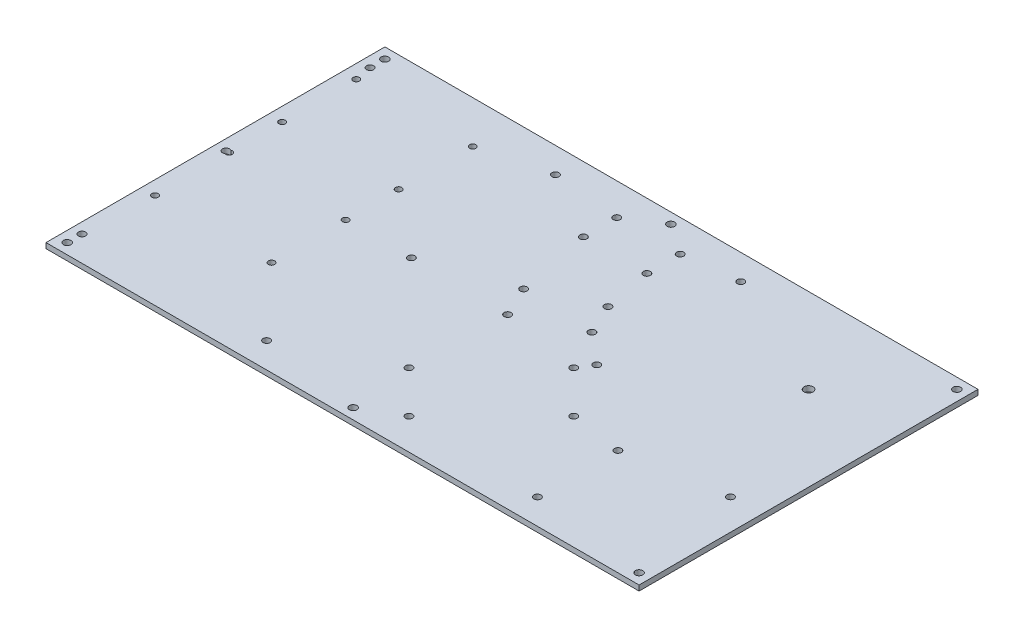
ISO-10303-21;
HEADER;
FILE_DESCRIPTION(('STEP AP214'),'2;1');
FILE_NAME('part.step','',(''),(''),'','','');
FILE_SCHEMA(('AUTOMOTIVE_DESIGN { 1 0 10303 214 1 1 1 1 }'));
ENDSEC;
DATA;
#1=APPLICATION_CONTEXT('core data for automotive mechanical design processes');
#2=APPLICATION_PROTOCOL_DEFINITION('international standard','automotive_design',2000,#1);
#3=PRODUCT_CONTEXT('',#1,'mechanical');
#4=PRODUCT('Part','Part','',(#3));
#5=PRODUCT_RELATED_PRODUCT_CATEGORY('part','',(#4));
#6=PRODUCT_DEFINITION_FORMATION('','',#4);
#7=PRODUCT_DEFINITION_CONTEXT('part definition',#1,'design');
#8=PRODUCT_DEFINITION('design','',#6,#7);
#9=PRODUCT_DEFINITION_SHAPE('','',#8);
#10=(LENGTH_UNIT() NAMED_UNIT(*) SI_UNIT(.MILLI.,.METRE.));
#11=(NAMED_UNIT(*) PLANE_ANGLE_UNIT() SI_UNIT($,.RADIAN.));
#12=(NAMED_UNIT(*) SI_UNIT($,.STERADIAN.) SOLID_ANGLE_UNIT());
#13=UNCERTAINTY_MEASURE_WITH_UNIT(LENGTH_MEASURE(1.E-05),#10,'distance_accuracy_value','');
#14=(GEOMETRIC_REPRESENTATION_CONTEXT(3) GLOBAL_UNCERTAINTY_ASSIGNED_CONTEXT((#13)) GLOBAL_UNIT_ASSIGNED_CONTEXT((#10,
#11,#12)) REPRESENTATION_CONTEXT('',''));
#15=CARTESIAN_POINT('',(0.,0.,0.));
#16=DIRECTION('',(0.,0.,1.));
#17=DIRECTION('',(1.,0.,0.));
#18=AXIS2_PLACEMENT_3D('',#15,#16,#17);
#19=CARTESIAN_POINT('',(0.,3.175,0.));
#20=DIRECTION('',(1.,0.,0.));
#21=DIRECTION('',(0.,0.,-1.));
#22=AXIS2_PLACEMENT_3D('',#19,#20,#21);
#23=PLANE('',#22);
#24=DIRECTION('',(0.,0.,1.));
#25=VECTOR('',#24,1.);
#26=CARTESIAN_POINT('',(0.,0.,0.));
#27=LINE('',#26,#25);
#28=CARTESIAN_POINT('',(0.,0.,-203.2));
#29=VERTEX_POINT('',#28);
#30=CARTESIAN_POINT('',(0.,0.,0.));
#31=VERTEX_POINT('',#30);
#32=EDGE_CURVE('E189',#29,#31,#27,.T.);
#33=ORIENTED_EDGE('',*,*,#32,.T.);
#34=DIRECTION('',(0.,-1.,0.));
#35=VECTOR('',#34,1.);
#36=CARTESIAN_POINT('',(0.,3.175,0.));
#37=LINE('',#36,#35);
#38=CARTESIAN_POINT('',(0.,3.175,0.));
#39=VERTEX_POINT('',#38);
#40=EDGE_CURVE('E99',#39,#31,#37,.T.);
#41=ORIENTED_EDGE('',*,*,#40,.F.);
#42=DIRECTION('',(0.,0.,1.));
#43=VECTOR('',#42,1.);
#44=CARTESIAN_POINT('',(0.,3.175,0.));
#45=LINE('',#44,#43);
#46=CARTESIAN_POINT('',(0.,3.175,-203.2));
#47=VERTEX_POINT('',#46);
#48=EDGE_CURVE('E190',#47,#39,#45,.T.);
#49=ORIENTED_EDGE('',*,*,#48,.F.);
#50=DIRECTION('',(0.,-1.,0.));
#51=VECTOR('',#50,1.);
#52=CARTESIAN_POINT('',(0.,3.175,-203.2));
#53=LINE('',#52,#51);
#54=EDGE_CURVE('E196',#47,#29,#53,.T.);
#55=ORIENTED_EDGE('',*,*,#54,.T.);
#56=EDGE_LOOP('',(#33,#41,#49,#55));
#57=FACE_BOUND('',#56,.T.);
#58=ADVANCED_FACE('F33',(#57),#23,.F.);
#59=CARTESIAN_POINT('',(0.,3.175,0.));
#60=DIRECTION('',(0.,0.,-1.));
#61=DIRECTION('',(-1.,0.,0.));
#62=AXIS2_PLACEMENT_3D('',#59,#60,#61);
#63=PLANE('',#62);
#64=DIRECTION('',(1.,0.,0.));
#65=VECTOR('',#64,1.);
#66=CARTESIAN_POINT('',(0.,0.,0.));
#67=LINE('',#66,#65);
#68=CARTESIAN_POINT('',(355.6,0.,0.));
#69=VERTEX_POINT('',#68);
#70=EDGE_CURVE('E199',#31,#69,#67,.T.);
#71=ORIENTED_EDGE('',*,*,#70,.T.);
#72=DIRECTION('',(0.,-1.,0.));
#73=VECTOR('',#72,1.);
#74=CARTESIAN_POINT('',(355.6,3.175,0.));
#75=LINE('',#74,#73);
#76=CARTESIAN_POINT('',(355.6,3.175,0.));
#77=VERTEX_POINT('',#76);
#78=EDGE_CURVE('E207',#77,#69,#75,.T.);
#79=ORIENTED_EDGE('',*,*,#78,.F.);
#80=DIRECTION('',(1.,0.,0.));
#81=VECTOR('',#80,1.);
#82=CARTESIAN_POINT('',(0.,3.175,0.));
#83=LINE('',#82,#81);
#84=EDGE_CURVE('E85',#39,#77,#83,.T.);
#85=ORIENTED_EDGE('',*,*,#84,.F.);
#86=ORIENTED_EDGE('',*,*,#40,.T.);
#87=EDGE_LOOP('',(#71,#79,#85,#86));
#88=FACE_BOUND('',#87,.T.);
#89=ADVANCED_FACE('F211',(#88),#63,.F.);
#90=CARTESIAN_POINT('',(355.6,3.175,0.));
#91=DIRECTION('',(-1.,0.,0.));
#92=DIRECTION('',(0.,0.,1.));
#93=AXIS2_PLACEMENT_3D('',#90,#91,#92);
#94=PLANE('',#93);
#95=DIRECTION('',(0.,0.,-1.));
#96=VECTOR('',#95,1.);
#97=CARTESIAN_POINT('',(355.6,0.,0.));
#98=LINE('',#97,#96);
#99=CARTESIAN_POINT('',(355.6,0.,-203.2));
#100=VERTEX_POINT('',#99);
#101=EDGE_CURVE('E201',#69,#100,#98,.T.);
#102=ORIENTED_EDGE('',*,*,#101,.T.);
#103=DIRECTION('',(0.,-1.,0.));
#104=VECTOR('',#103,1.);
#105=CARTESIAN_POINT('',(355.6,3.175,-203.2));
#106=LINE('',#105,#104);
#107=CARTESIAN_POINT('',(355.6,3.175,-203.2));
#108=VERTEX_POINT('',#107);
#109=EDGE_CURVE('E205',#108,#100,#106,.T.);
#110=ORIENTED_EDGE('',*,*,#109,.F.);
#111=DIRECTION('',(0.,0.,-1.));
#112=VECTOR('',#111,1.);
#113=CARTESIAN_POINT('',(355.6,3.175,0.));
#114=LINE('',#113,#112);
#115=EDGE_CURVE('E193',#77,#108,#114,.T.);
#116=ORIENTED_EDGE('',*,*,#115,.F.);
#117=ORIENTED_EDGE('',*,*,#78,.T.);
#118=EDGE_LOOP('',(#102,#110,#116,#117));
#119=FACE_BOUND('',#118,.T.);
#120=ADVANCED_FACE('F219',(#119),#94,.F.);
#121=CARTESIAN_POINT('',(0.,3.175,-203.2));
#122=DIRECTION('',(0.,0.,1.));
#123=DIRECTION('',(1.,0.,0.));
#124=AXIS2_PLACEMENT_3D('',#121,#122,#123);
#125=PLANE('',#124);
#126=DIRECTION('',(-1.,0.,0.));
#127=VECTOR('',#126,1.);
#128=CARTESIAN_POINT('',(0.,0.,-203.2));
#129=LINE('',#128,#127);
#130=EDGE_CURVE('E77',#100,#29,#129,.T.);
#131=ORIENTED_EDGE('',*,*,#130,.T.);
#132=ORIENTED_EDGE('',*,*,#54,.F.);
#133=DIRECTION('',(-1.,0.,0.));
#134=VECTOR('',#133,1.);
#135=CARTESIAN_POINT('',(0.,3.175,-203.2));
#136=LINE('',#135,#134);
#137=EDGE_CURVE('E56',#108,#47,#136,.T.);
#138=ORIENTED_EDGE('',*,*,#137,.F.);
#139=ORIENTED_EDGE('',*,*,#109,.T.);
#140=EDGE_LOOP('',(#131,#132,#138,#139));
#141=FACE_BOUND('',#140,.T.);
#142=ADVANCED_FACE('F221',(#141),#125,.F.);
#143=CARTESIAN_POINT('',(0.,3.175,0.));
#144=DIRECTION('',(0.,-1.,0.));
#145=DIRECTION('',(0.,0.,-1.));
#146=AXIS2_PLACEMENT_3D('',#143,#144,#145);
#147=PLANE('',#146);
#148=CARTESIAN_POINT('',(304.8,3.175,-152.4));
#149=DIRECTION('',(0.,1.,0.));
#150=DIRECTION('',(0.,0.,1.));
#151=AXIS2_PLACEMENT_3D('',#148,#149,#150);
#152=CIRCLE('',#151,2.70510000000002);
#153=CARTESIAN_POINT('',(304.8,3.175,-149.6949));
#154=VERTEX_POINT('',#153);
#155=EDGE_CURVE('E642',#154,#154,#152,.T.);
#156=ORIENTED_EDGE('',*,*,#155,.F.);
#157=EDGE_LOOP('',(#156));
#158=FACE_BOUND('',#157,.T.);
#159=CARTESIAN_POINT('',(158.144890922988,3.175,-164.06281126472));
#160=DIRECTION('',(0.,1.,0.));
#161=DIRECTION('',(0.,0.,1.));
#162=AXIS2_PLACEMENT_3D('',#159,#160,#161);
#163=CIRCLE('',#162,2.10819999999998);
#164=CARTESIAN_POINT('',(158.144890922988,3.175,-161.95461126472));
#165=VERTEX_POINT('',#164);
#166=EDGE_CURVE('E644',#165,#165,#163,.T.);
#167=ORIENTED_EDGE('',*,*,#166,.F.);
#168=EDGE_LOOP('',(#167));
#169=FACE_BOUND('',#168,.T.);
#170=CARTESIAN_POINT('',(158.117742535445,3.175,-184.062792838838));
#171=DIRECTION('',(0.,1.,0.));
#172=DIRECTION('',(0.,0.,1.));
#173=AXIS2_PLACEMENT_3D('',#170,#171,#172);
#174=CIRCLE('',#173,2.10819999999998);
#175=CARTESIAN_POINT('',(158.117742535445,3.175,-181.954592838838));
#176=VERTEX_POINT('',#175);
#177=EDGE_CURVE('E652',#176,#176,#174,.T.);
#178=ORIENTED_EDGE('',*,*,#177,.F.);
#179=EDGE_LOOP('',(#178));
#180=FACE_BOUND('',#179,.T.);
#181=CARTESIAN_POINT('',(196.117707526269,3.175,-184.114374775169));
#182=DIRECTION('',(0.,1.,0.));
#183=DIRECTION('',(0.,0.,1.));
#184=AXIS2_PLACEMENT_3D('',#181,#182,#183);
#185=CIRCLE('',#184,2.10819999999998);
#186=CARTESIAN_POINT('',(196.117707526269,3.175,-182.006174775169));
#187=VERTEX_POINT('',#186);
#188=EDGE_CURVE('E658',#187,#187,#185,.T.);
#189=ORIENTED_EDGE('',*,*,#188,.F.);
#190=EDGE_LOOP('',(#189));
#191=FACE_BOUND('',#190,.T.);
#192=CARTESIAN_POINT('',(196.144855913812,3.175,-164.114393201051));
#193=DIRECTION('',(0.,1.,0.));
#194=DIRECTION('',(0.,0.,1.));
#195=AXIS2_PLACEMENT_3D('',#192,#193,#194);
#196=CIRCLE('',#195,2.10819999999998);
#197=CARTESIAN_POINT('',(196.144855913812,3.175,-162.006193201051));
#198=VERTEX_POINT('',#197);
#199=EDGE_CURVE('E664',#198,#198,#196,.T.);
#200=ORIENTED_EDGE('',*,*,#199,.F.);
#201=EDGE_LOOP('',(#200));
#202=FACE_BOUND('',#201,.T.);
#203=CARTESIAN_POINT('',(167.302257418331,3.175,-119.108761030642));
#204=DIRECTION('',(0.,1.,0.));
#205=DIRECTION('',(0.,0.,1.));
#206=AXIS2_PLACEMENT_3D('',#203,#204,#205);
#207=CIRCLE('',#206,2.10819999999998);
#208=CARTESIAN_POINT('',(167.302257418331,3.175,-117.000561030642));
#209=VERTEX_POINT('',#208);
#210=EDGE_CURVE('E670',#209,#209,#207,.T.);
#211=ORIENTED_EDGE('',*,*,#210,.F.);
#212=EDGE_LOOP('',(#211));
#213=FACE_BOUND('',#212,.T.);
#214=CARTESIAN_POINT('',(175.779219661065,3.175,-100.994095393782));
#215=DIRECTION('',(0.,1.,0.));
#216=DIRECTION('',(0.,0.,1.));
#217=AXIS2_PLACEMENT_3D('',#214,#215,#216);
#218=CIRCLE('',#217,2.10819999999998);
#219=CARTESIAN_POINT('',(175.779219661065,3.175,-98.8858953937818));
#220=VERTEX_POINT('',#219);
#221=EDGE_CURVE('E676',#220,#220,#218,.T.);
#222=ORIENTED_EDGE('',*,*,#221,.F.);
#223=EDGE_LOOP('',(#222));
#224=FACE_BOUND('',#223,.T.);
#225=CARTESIAN_POINT('',(210.1970843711,3.175,-117.100323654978));
#226=DIRECTION('',(0.,1.,0.));
#227=DIRECTION('',(0.,0.,1.));
#228=AXIS2_PLACEMENT_3D('',#225,#226,#227);
#229=CIRCLE('',#228,2.10819999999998);
#230=CARTESIAN_POINT('',(210.1970843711,3.175,-114.992123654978));
#231=VERTEX_POINT('',#230);
#232=EDGE_CURVE('E682',#231,#231,#229,.T.);
#233=ORIENTED_EDGE('',*,*,#232,.F.);
#234=EDGE_LOOP('',(#233));
#235=FACE_BOUND('',#234,.T.);
#236=CARTESIAN_POINT('',(201.720122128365,3.175,-135.214989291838));
#237=DIRECTION('',(0.,1.,0.));
#238=DIRECTION('',(0.,0.,1.));
#239=AXIS2_PLACEMENT_3D('',#236,#237,#238);
#240=CIRCLE('',#239,2.10819999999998);
#241=CARTESIAN_POINT('',(201.720122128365,3.175,-133.106789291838));
#242=VERTEX_POINT('',#241);
#243=EDGE_CURVE('E688',#242,#242,#240,.T.);
#244=ORIENTED_EDGE('',*,*,#243,.F.);
#245=EDGE_LOOP('',(#244));
#246=FACE_BOUND('',#245,.T.);
#247=CARTESIAN_POINT('',(6.35,3.175,-187.96));
#248=DIRECTION('',(0.,1.,0.));
#249=DIRECTION('',(0.,0.,1.));
#250=AXIS2_PLACEMENT_3D('',#247,#248,#249);
#251=CIRCLE('',#250,2.10819999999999);
#252=CARTESIAN_POINT('',(6.35,3.175,-185.8518));
#253=VERTEX_POINT('',#252);
#254=EDGE_CURVE('E694',#253,#253,#251,.T.);
#255=ORIENTED_EDGE('',*,*,#254,.F.);
#256=EDGE_LOOP('',(#255));
#257=FACE_BOUND('',#256,.T.);
#258=CARTESIAN_POINT('',(6.35000000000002,3.175,-15.24));
#259=DIRECTION('',(0.,1.,0.));
#260=DIRECTION('',(0.,0.,1.));
#261=AXIS2_PLACEMENT_3D('',#258,#259,#260);
#262=CIRCLE('',#261,2.10819999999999);
#263=CARTESIAN_POINT('',(6.35000000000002,3.175,-13.1318));
#264=VERTEX_POINT('',#263);
#265=EDGE_CURVE('E105',#264,#264,#262,.T.);
#266=ORIENTED_EDGE('',*,*,#265,.F.);
#267=EDGE_LOOP('',(#266));
#268=FACE_BOUND('',#267,.T.);
#269=CARTESIAN_POINT('',(117.018728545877,3.175,-15.24));
#270=DIRECTION('',(0.,1.,0.));
#271=DIRECTION('',(0.,0.,1.));
#272=AXIS2_PLACEMENT_3D('',#269,#270,#271);
#273=CIRCLE('',#272,2.10819999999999);
#274=CARTESIAN_POINT('',(117.018728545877,3.175,-13.1318));
#275=VERTEX_POINT('',#274);
#276=EDGE_CURVE('E706',#275,#275,#273,.T.);
#277=ORIENTED_EDGE('',*,*,#276,.F.);
#278=EDGE_LOOP('',(#277));
#279=FACE_BOUND('',#278,.T.);
#280=CARTESIAN_POINT('',(117.475,3.175,-101.6));
#281=DIRECTION('',(0.,1.,0.));
#282=DIRECTION('',(0.,0.,1.));
#283=AXIS2_PLACEMENT_3D('',#280,#281,#282);
#284=CIRCLE('',#283,2.10819999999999);
#285=CARTESIAN_POINT('',(117.475,3.175,-99.4918));
#286=VERTEX_POINT('',#285);
#287=EDGE_CURVE('E712',#286,#286,#284,.T.);
#288=ORIENTED_EDGE('',*,*,#287,.F.);
#289=EDGE_LOOP('',(#288));
#290=FACE_BOUND('',#289,.T.);
#291=CARTESIAN_POINT('',(117.475,3.175,-187.96));
#292=DIRECTION('',(0.,1.,0.));
#293=DIRECTION('',(0.,0.,1.));
#294=AXIS2_PLACEMENT_3D('',#291,#292,#293);
#295=CIRCLE('',#294,2.10819999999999);
#296=CARTESIAN_POINT('',(117.475,3.175,-185.8518));
#297=VERTEX_POINT('',#296);
#298=EDGE_CURVE('E718',#297,#297,#295,.T.);
#299=ORIENTED_EDGE('',*,*,#298,.F.);
#300=EDGE_LOOP('',(#299));
#301=FACE_BOUND('',#300,.T.);
#302=CARTESIAN_POINT('',(228.6,3.175,-187.96));
#303=DIRECTION('',(0.,1.,0.));
#304=DIRECTION('',(0.,0.,1.));
#305=AXIS2_PLACEMENT_3D('',#302,#303,#304);
#306=CIRCLE('',#305,2.10819999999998);
#307=CARTESIAN_POINT('',(228.6,3.175,-185.8518));
#308=VERTEX_POINT('',#307);
#309=EDGE_CURVE('E724',#308,#308,#306,.T.);
#310=ORIENTED_EDGE('',*,*,#309,.F.);
#311=EDGE_LOOP('',(#310));
#312=FACE_BOUND('',#311,.T.);
#313=CARTESIAN_POINT('',(228.6,3.175,-101.6));
#314=DIRECTION('',(0.,1.,0.));
#315=DIRECTION('',(0.,0.,1.));
#316=AXIS2_PLACEMENT_3D('',#313,#314,#315);
#317=CIRCLE('',#316,2.10819999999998);
#318=CARTESIAN_POINT('',(228.6,3.175,-99.4918));
#319=VERTEX_POINT('',#318);
#320=EDGE_CURVE('E730',#319,#319,#317,.T.);
#321=ORIENTED_EDGE('',*,*,#320,.F.);
#322=EDGE_LOOP('',(#321));
#323=FACE_BOUND('',#322,.T.);
#324=CARTESIAN_POINT('',(279.4,3.175,-63.5));
#325=DIRECTION('',(0.,1.,0.));
#326=DIRECTION('',(0.,0.,1.));
#327=AXIS2_PLACEMENT_3D('',#324,#325,#326);
#328=CIRCLE('',#327,2.1082);
#329=CARTESIAN_POINT('',(279.4,3.175,-61.3918));
#330=VERTEX_POINT('',#329);
#331=EDGE_CURVE('E736',#330,#330,#328,.T.);
#332=ORIENTED_EDGE('',*,*,#331,.F.);
#333=EDGE_LOOP('',(#332));
#334=FACE_BOUND('',#333,.T.);
#335=CARTESIAN_POINT('',(279.4,3.175,-15.24));
#336=DIRECTION('',(0.,1.,0.));
#337=DIRECTION('',(0.,0.,1.));
#338=AXIS2_PLACEMENT_3D('',#335,#336,#337);
#339=CIRCLE('',#338,2.1082);
#340=CARTESIAN_POINT('',(279.4,3.175,-13.1318));
#341=VERTEX_POINT('',#340);
#342=EDGE_CURVE('E742',#341,#341,#339,.T.);
#343=ORIENTED_EDGE('',*,*,#342,.F.);
#344=EDGE_LOOP('',(#343));
#345=FACE_BOUND('',#344,.T.);
#346=CARTESIAN_POINT('',(173.824558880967,3.175,-43.7970472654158));
#347=DIRECTION('',(0.,1.,0.));
#348=DIRECTION('',(0.,0.,1.));
#349=AXIS2_PLACEMENT_3D('',#346,#347,#348);
#350=CIRCLE('',#349,2.1082);
#351=CARTESIAN_POINT('',(173.824558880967,3.175,-41.6888472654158));
#352=VERTEX_POINT('',#351);
#353=EDGE_CURVE('E748',#352,#352,#350,.T.);
#354=ORIENTED_EDGE('',*,*,#353,.F.);
#355=EDGE_LOOP('',(#354));
#356=FACE_BOUND('',#355,.T.);
#357=CARTESIAN_POINT('',(223.215967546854,3.175,-93.1884559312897));
#358=DIRECTION('',(0.,1.,0.));
#359=DIRECTION('',(0.,0.,1.));
#360=AXIS2_PLACEMENT_3D('',#357,#358,#359);
#361=CIRCLE('',#360,2.1082);
#362=CARTESIAN_POINT('',(223.215967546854,3.175,-91.0802559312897));
#363=VERTEX_POINT('',#362);
#364=EDGE_CURVE('E754',#363,#363,#361,.T.);
#365=ORIENTED_EDGE('',*,*,#364,.F.);
#366=EDGE_LOOP('',(#365));
#367=FACE_BOUND('',#366,.T.);
#368=CARTESIAN_POINT('',(248.360684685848,3.175,-68.043738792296));
#369=DIRECTION('',(0.,1.,0.));
#370=DIRECTION('',(0.,0.,1.));
#371=AXIS2_PLACEMENT_3D('',#368,#369,#370);
#372=CIRCLE('',#371,2.1082);
#373=CARTESIAN_POINT('',(248.360684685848,3.175,-65.935538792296));
#374=VERTEX_POINT('',#373);
#375=EDGE_CURVE('E760',#374,#374,#372,.T.);
#376=ORIENTED_EDGE('',*,*,#375,.F.);
#377=EDGE_LOOP('',(#376));
#378=FACE_BOUND('',#377,.T.);
#379=CARTESIAN_POINT('',(198.969276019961,3.175,-18.652330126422));
#380=DIRECTION('',(0.,1.,0.));
#381=DIRECTION('',(0.,0.,1.));
#382=AXIS2_PLACEMENT_3D('',#379,#380,#381);
#383=CIRCLE('',#382,2.1082);
#384=CARTESIAN_POINT('',(198.969276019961,3.175,-16.544130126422));
#385=VERTEX_POINT('',#384);
#386=EDGE_CURVE('E766',#385,#385,#383,.T.);
#387=ORIENTED_EDGE('',*,*,#386,.F.);
#388=EDGE_LOOP('',(#387));
#389=FACE_BOUND('',#388,.T.);
#390=CARTESIAN_POINT('',(337.269144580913,3.175,-73.1366321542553));
#391=DIRECTION('',(0.,1.,0.));
#392=DIRECTION('',(0.,0.,1.));
#393=AXIS2_PLACEMENT_3D('',#390,#391,#392);
#394=CIRCLE('',#393,2.1082);
#395=CARTESIAN_POINT('',(337.269144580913,3.175,-71.0284321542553));
#396=VERTEX_POINT('',#395);
#397=EDGE_CURVE('E772',#396,#396,#394,.T.);
#398=ORIENTED_EDGE('',*,*,#397,.F.);
#399=EDGE_LOOP('',(#398));
#400=FACE_BOUND('',#399,.T.);
#401=CARTESIAN_POINT('',(8.20480615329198,3.175,-57.1682735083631));
#402=DIRECTION('',(0.,-1.,0.));
#403=DIRECTION('',(0.,0.,-1.));
#404=AXIS2_PLACEMENT_3D('',#401,#402,#403);
#405=CIRCLE('',#404,1.89865);
#406=CARTESIAN_POINT('',(8.20480615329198,3.175,-59.0669235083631));
#407=VERTEX_POINT('',#406);
#408=EDGE_CURVE('E109',#407,#407,#405,.T.);
#409=ORIENTED_EDGE('',*,*,#408,.T.);
#410=EDGE_LOOP('',(#409));
#411=FACE_BOUND('',#410,.T.);
#412=CARTESIAN_POINT('',(8.20480615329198,3.175,-101.618273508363));
#413=DIRECTION('',(0.,-1.,0.));
#414=DIRECTION('',(0.,0.,-1.));
#415=AXIS2_PLACEMENT_3D('',#412,#413,#414);
#416=CIRCLE('',#415,1.89865);
#417=CARTESIAN_POINT('',(7.4863390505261,3.175,-103.375736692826));
#418=VERTEX_POINT('',#417);
#419=CARTESIAN_POINT('',(7.52110412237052,3.175,-99.846996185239));
#420=VERTEX_POINT('',#419);
#421=EDGE_CURVE('E108',#418,#420,#416,.T.);
#422=ORIENTED_EDGE('',*,*,#421,.T.);
#423=CARTESIAN_POINT('',(6.35000000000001,3.175,-101.6));
#424=DIRECTION('',(0.,1.,0.));
#425=DIRECTION('',(0.,0.,1.));
#426=AXIS2_PLACEMENT_3D('',#423,#424,#425);
#427=CIRCLE('',#426,2.10819999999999);
#428=EDGE_CURVE('E47',#418,#420,#427,.T.);
#429=ORIENTED_EDGE('',*,*,#428,.F.);
#430=EDGE_LOOP('',(#422,#429));
#431=FACE_BOUND('',#430,.T.);
#432=CARTESIAN_POINT('',(78.054806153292,3.175,-101.618273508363));
#433=DIRECTION('',(0.,-1.,0.));
#434=DIRECTION('',(0.,0.,-1.));
#435=AXIS2_PLACEMENT_3D('',#432,#433,#434);
#436=CIRCLE('',#435,1.89865);
#437=CARTESIAN_POINT('',(78.054806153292,3.175,-103.516923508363));
#438=VERTEX_POINT('',#437);
#439=EDGE_CURVE('E120',#438,#438,#436,.T.);
#440=ORIENTED_EDGE('',*,*,#439,.T.);
#441=EDGE_LOOP('',(#440));
#442=FACE_BOUND('',#441,.T.);
#443=CARTESIAN_POINT('',(78.054806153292,3.175,-57.1682735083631));
#444=DIRECTION('',(0.,-1.,0.));
#445=DIRECTION('',(0.,0.,-1.));
#446=AXIS2_PLACEMENT_3D('',#443,#444,#445);
#447=CIRCLE('',#446,1.89865);
#448=CARTESIAN_POINT('',(78.054806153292,3.175,-59.0669235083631));
#449=VERTEX_POINT('',#448);
#450=EDGE_CURVE('E126',#449,#449,#447,.T.);
#451=ORIENTED_EDGE('',*,*,#450,.T.);
#452=EDGE_LOOP('',(#451));
#453=FACE_BOUND('',#452,.T.);
#454=CARTESIAN_POINT('',(8.20480615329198,3.175,-133.368273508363));
#455=DIRECTION('',(0.,-1.,0.));
#456=DIRECTION('',(0.,0.,-1.));
#457=AXIS2_PLACEMENT_3D('',#454,#455,#456);
#458=CIRCLE('',#457,1.89865);
#459=CARTESIAN_POINT('',(8.20480615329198,3.175,-135.266923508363));
#460=VERTEX_POINT('',#459);
#461=EDGE_CURVE('E132',#460,#460,#458,.T.);
#462=ORIENTED_EDGE('',*,*,#461,.T.);
#463=EDGE_LOOP('',(#462));
#464=FACE_BOUND('',#463,.T.);
#465=CARTESIAN_POINT('',(78.054806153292,3.175,-133.368273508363));
#466=DIRECTION('',(0.,-1.,0.));
#467=DIRECTION('',(0.,0.,-1.));
#468=AXIS2_PLACEMENT_3D('',#465,#466,#467);
#469=CIRCLE('',#468,1.89865);
#470=CARTESIAN_POINT('',(78.054806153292,3.175,-135.266923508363));
#471=VERTEX_POINT('',#470);
#472=EDGE_CURVE('E138',#471,#471,#469,.T.);
#473=ORIENTED_EDGE('',*,*,#472,.T.);
#474=EDGE_LOOP('',(#473));
#475=FACE_BOUND('',#474,.T.);
#476=CARTESIAN_POINT('',(78.054806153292,3.175,-177.818273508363));
#477=DIRECTION('',(0.,-1.,0.));
#478=DIRECTION('',(0.,0.,-1.));
#479=AXIS2_PLACEMENT_3D('',#476,#477,#478);
#480=CIRCLE('',#479,1.89865);
#481=CARTESIAN_POINT('',(78.054806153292,3.175,-179.716923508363));
#482=VERTEX_POINT('',#481);
#483=EDGE_CURVE('E144',#482,#482,#480,.T.);
#484=ORIENTED_EDGE('',*,*,#483,.T.);
#485=EDGE_LOOP('',(#484));
#486=FACE_BOUND('',#485,.T.);
#487=CARTESIAN_POINT('',(8.20480615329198,3.175,-177.818273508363));
#488=DIRECTION('',(0.,-1.,0.));
#489=DIRECTION('',(0.,0.,-1.));
#490=AXIS2_PLACEMENT_3D('',#487,#488,#489);
#491=CIRCLE('',#490,1.89865);
#492=CARTESIAN_POINT('',(8.20480615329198,3.175,-179.716923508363));
#493=VERTEX_POINT('',#492);
#494=EDGE_CURVE('E150',#493,#493,#491,.T.);
#495=ORIENTED_EDGE('',*,*,#494,.T.);
#496=EDGE_LOOP('',(#495));
#497=FACE_BOUND('',#496,.T.);
#498=CARTESIAN_POINT('',(6.35,3.175,-196.85));
#499=DIRECTION('',(0.,1.,0.));
#500=DIRECTION('',(0.,0.,1.));
#501=AXIS2_PLACEMENT_3D('',#498,#499,#500);
#502=CIRCLE('',#501,2.24789999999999);
#503=CARTESIAN_POINT('',(6.35,3.175,-194.6021));
#504=VERTEX_POINT('',#503);
#505=EDGE_CURVE('E153',#504,#504,#502,.T.);
#506=ORIENTED_EDGE('',*,*,#505,.F.);
#507=EDGE_LOOP('',(#506));
#508=FACE_BOUND('',#507,.T.);
#509=CARTESIAN_POINT('',(177.8,3.175,-196.85));
#510=DIRECTION('',(0.,1.,0.));
#511=DIRECTION('',(0.,0.,1.));
#512=AXIS2_PLACEMENT_3D('',#509,#510,#511);
#513=CIRCLE('',#512,2.2479);
#514=CARTESIAN_POINT('',(177.8,3.175,-194.6021));
#515=VERTEX_POINT('',#514);
#516=EDGE_CURVE('E159',#515,#515,#513,.T.);
#517=ORIENTED_EDGE('',*,*,#516,.F.);
#518=EDGE_LOOP('',(#517));
#519=FACE_BOUND('',#518,.T.);
#520=CARTESIAN_POINT('',(349.25,3.175,-196.85));
#521=DIRECTION('',(0.,1.,0.));
#522=DIRECTION('',(0.,0.,1.));
#523=AXIS2_PLACEMENT_3D('',#520,#521,#522);
#524=CIRCLE('',#523,2.24789999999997);
#525=CARTESIAN_POINT('',(349.25,3.175,-194.6021));
#526=VERTEX_POINT('',#525);
#527=EDGE_CURVE('E165',#526,#526,#524,.T.);
#528=ORIENTED_EDGE('',*,*,#527,.F.);
#529=EDGE_LOOP('',(#528));
#530=FACE_BOUND('',#529,.T.);
#531=CARTESIAN_POINT('',(349.25,3.175,-6.35));
#532=DIRECTION('',(0.,1.,0.));
#533=DIRECTION('',(0.,0.,1.));
#534=AXIS2_PLACEMENT_3D('',#531,#532,#533);
#535=CIRCLE('',#534,2.24789999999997);
#536=CARTESIAN_POINT('',(349.25,3.175,-4.10210000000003));
#537=VERTEX_POINT('',#536);
#538=EDGE_CURVE('E171',#537,#537,#535,.T.);
#539=ORIENTED_EDGE('',*,*,#538,.F.);
#540=EDGE_LOOP('',(#539));
#541=FACE_BOUND('',#540,.T.);
#542=CARTESIAN_POINT('',(177.8,3.175,-6.34999999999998));
#543=DIRECTION('',(0.,1.,0.));
#544=DIRECTION('',(0.,0.,1.));
#545=AXIS2_PLACEMENT_3D('',#542,#543,#544);
#546=CIRCLE('',#545,2.2479);
#547=CARTESIAN_POINT('',(177.8,3.175,-4.10209999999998));
#548=VERTEX_POINT('',#547);
#549=EDGE_CURVE('E177',#548,#548,#546,.T.);
#550=ORIENTED_EDGE('',*,*,#549,.F.);
#551=EDGE_LOOP('',(#550));
#552=FACE_BOUND('',#551,.T.);
#553=CARTESIAN_POINT('',(6.35,3.175,-6.34999999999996));
#554=DIRECTION('',(0.,1.,0.));
#555=DIRECTION('',(0.,0.,1.));
#556=AXIS2_PLACEMENT_3D('',#553,#554,#555);
#557=CIRCLE('',#556,2.24789999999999);
#558=CARTESIAN_POINT('',(6.35,3.175,-4.10209999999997));
#559=VERTEX_POINT('',#558);
#560=EDGE_CURVE('E183',#559,#559,#557,.T.);
#561=ORIENTED_EDGE('',*,*,#560,.F.);
#562=EDGE_LOOP('',(#561));
#563=FACE_BOUND('',#562,.T.);
#564=ORIENTED_EDGE('',*,*,#48,.T.);
#565=ORIENTED_EDGE('',*,*,#84,.T.);
#566=ORIENTED_EDGE('',*,*,#115,.T.);
#567=ORIENTED_EDGE('',*,*,#137,.T.);
#568=EDGE_LOOP('',(#564,#565,#566,#567));
#569=FACE_BOUND('',#568,.T.);
#570=ADVANCED_FACE('F222',(#158,#169,#180,#191,#202,#213,#224,#235,#246,#257,#268,#279,#290,
#301,#312,#323,#334,#345,#356,#367,#378,#389,#400,#411,#431,#442,#453,#464,#475,#486,#497,#508,
#519,#530,#541,#552,#563,#569),#147,.F.);
#571=CARTESIAN_POINT('',(0.,0.,0.));
#572=DIRECTION('',(0.,-1.,0.));
#573=DIRECTION('',(0.,0.,-1.));
#574=AXIS2_PLACEMENT_3D('',#571,#572,#573);
#575=PLANE('',#574);
#576=CARTESIAN_POINT('',(304.8,0.,-152.4));
#577=DIRECTION('',(0.,1.,0.));
#578=DIRECTION('',(0.,0.,1.));
#579=AXIS2_PLACEMENT_3D('',#576,#577,#578);
#580=CIRCLE('',#579,2.70510000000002);
#581=CARTESIAN_POINT('',(304.8,0.,-149.6949));
#582=VERTEX_POINT('',#581);
#583=EDGE_CURVE('E640',#582,#582,#580,.T.);
#584=ORIENTED_EDGE('',*,*,#583,.T.);
#585=EDGE_LOOP('',(#584));
#586=FACE_BOUND('',#585,.T.);
#587=CARTESIAN_POINT('',(158.144890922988,0.,-164.06281126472));
#588=DIRECTION('',(0.,1.,0.));
#589=DIRECTION('',(0.,0.,1.));
#590=AXIS2_PLACEMENT_3D('',#587,#588,#589);
#591=CIRCLE('',#590,2.1082);
#592=CARTESIAN_POINT('',(158.144890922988,0.,-161.95461126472));
#593=VERTEX_POINT('',#592);
#594=EDGE_CURVE('E649',#593,#593,#591,.T.);
#595=ORIENTED_EDGE('',*,*,#594,.T.);
#596=EDGE_LOOP('',(#595));
#597=FACE_BOUND('',#596,.T.);
#598=CARTESIAN_POINT('',(158.117742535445,0.,-184.062792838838));
#599=DIRECTION('',(0.,1.,0.));
#600=DIRECTION('',(0.,0.,1.));
#601=AXIS2_PLACEMENT_3D('',#598,#599,#600);
#602=CIRCLE('',#601,2.1082);
#603=CARTESIAN_POINT('',(158.117742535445,0.,-181.954592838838));
#604=VERTEX_POINT('',#603);
#605=EDGE_CURVE('E655',#604,#604,#602,.T.);
#606=ORIENTED_EDGE('',*,*,#605,.T.);
#607=EDGE_LOOP('',(#606));
#608=FACE_BOUND('',#607,.T.);
#609=CARTESIAN_POINT('',(196.117707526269,0.,-184.114374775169));
#610=DIRECTION('',(0.,1.,0.));
#611=DIRECTION('',(0.,0.,1.));
#612=AXIS2_PLACEMENT_3D('',#609,#610,#611);
#613=CIRCLE('',#612,2.1082);
#614=CARTESIAN_POINT('',(196.117707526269,0.,-182.006174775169));
#615=VERTEX_POINT('',#614);
#616=EDGE_CURVE('E661',#615,#615,#613,.T.);
#617=ORIENTED_EDGE('',*,*,#616,.T.);
#618=EDGE_LOOP('',(#617));
#619=FACE_BOUND('',#618,.T.);
#620=CARTESIAN_POINT('',(196.144855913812,0.,-164.114393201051));
#621=DIRECTION('',(0.,1.,0.));
#622=DIRECTION('',(0.,0.,1.));
#623=AXIS2_PLACEMENT_3D('',#620,#621,#622);
#624=CIRCLE('',#623,2.1082);
#625=CARTESIAN_POINT('',(196.144855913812,0.,-162.006193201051));
#626=VERTEX_POINT('',#625);
#627=EDGE_CURVE('E667',#626,#626,#624,.T.);
#628=ORIENTED_EDGE('',*,*,#627,.T.);
#629=EDGE_LOOP('',(#628));
#630=FACE_BOUND('',#629,.T.);
#631=CARTESIAN_POINT('',(167.302257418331,0.,-119.108761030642));
#632=DIRECTION('',(0.,1.,0.));
#633=DIRECTION('',(0.,0.,1.));
#634=AXIS2_PLACEMENT_3D('',#631,#632,#633);
#635=CIRCLE('',#634,2.1082);
#636=CARTESIAN_POINT('',(167.302257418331,0.,-117.000561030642));
#637=VERTEX_POINT('',#636);
#638=EDGE_CURVE('E673',#637,#637,#635,.T.);
#639=ORIENTED_EDGE('',*,*,#638,.T.);
#640=EDGE_LOOP('',(#639));
#641=FACE_BOUND('',#640,.T.);
#642=CARTESIAN_POINT('',(175.779219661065,0.,-100.994095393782));
#643=DIRECTION('',(0.,1.,0.));
#644=DIRECTION('',(0.,0.,1.));
#645=AXIS2_PLACEMENT_3D('',#642,#643,#644);
#646=CIRCLE('',#645,2.1082);
#647=CARTESIAN_POINT('',(175.779219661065,0.,-98.8858953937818));
#648=VERTEX_POINT('',#647);
#649=EDGE_CURVE('E679',#648,#648,#646,.T.);
#650=ORIENTED_EDGE('',*,*,#649,.T.);
#651=EDGE_LOOP('',(#650));
#652=FACE_BOUND('',#651,.T.);
#653=CARTESIAN_POINT('',(210.1970843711,0.,-117.100323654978));
#654=DIRECTION('',(0.,1.,0.));
#655=DIRECTION('',(0.,0.,1.));
#656=AXIS2_PLACEMENT_3D('',#653,#654,#655);
#657=CIRCLE('',#656,2.1082);
#658=CARTESIAN_POINT('',(210.1970843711,0.,-114.992123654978));
#659=VERTEX_POINT('',#658);
#660=EDGE_CURVE('E685',#659,#659,#657,.T.);
#661=ORIENTED_EDGE('',*,*,#660,.T.);
#662=EDGE_LOOP('',(#661));
#663=FACE_BOUND('',#662,.T.);
#664=CARTESIAN_POINT('',(201.720122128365,0.,-135.214989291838));
#665=DIRECTION('',(0.,1.,0.));
#666=DIRECTION('',(0.,0.,1.));
#667=AXIS2_PLACEMENT_3D('',#664,#665,#666);
#668=CIRCLE('',#667,2.1082);
#669=CARTESIAN_POINT('',(201.720122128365,0.,-133.106789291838));
#670=VERTEX_POINT('',#669);
#671=EDGE_CURVE('E691',#670,#670,#668,.T.);
#672=ORIENTED_EDGE('',*,*,#671,.T.);
#673=EDGE_LOOP('',(#672));
#674=FACE_BOUND('',#673,.T.);
#675=CARTESIAN_POINT('',(6.35,0.,-187.96));
#676=DIRECTION('',(0.,1.,0.));
#677=DIRECTION('',(0.,0.,1.));
#678=AXIS2_PLACEMENT_3D('',#675,#676,#677);
#679=CIRCLE('',#678,2.1082);
#680=CARTESIAN_POINT('',(6.35,0.,-185.8518));
#681=VERTEX_POINT('',#680);
#682=EDGE_CURVE('E697',#681,#681,#679,.T.);
#683=ORIENTED_EDGE('',*,*,#682,.T.);
#684=EDGE_LOOP('',(#683));
#685=FACE_BOUND('',#684,.T.);
#686=CARTESIAN_POINT('',(6.35000000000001,0.,-101.6));
#687=DIRECTION('',(0.,1.,0.));
#688=DIRECTION('',(0.,0.,1.));
#689=AXIS2_PLACEMENT_3D('',#686,#687,#688);
#690=CIRCLE('',#689,2.1082);
#691=CARTESIAN_POINT('',(7.48633905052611,0.,-103.375736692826));
#692=VERTEX_POINT('',#691);
#693=CARTESIAN_POINT('',(7.52110412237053,0.,-99.846996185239));
#694=VERTEX_POINT('',#693);
#695=EDGE_CURVE('E94',#692,#694,#690,.T.);
#696=ORIENTED_EDGE('',*,*,#695,.T.);
#697=CARTESIAN_POINT('',(8.20480615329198,0.,-101.618273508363));
#698=DIRECTION('',(0.,-1.,0.));
#699=DIRECTION('',(0.,0.,-1.));
#700=AXIS2_PLACEMENT_3D('',#697,#698,#699);
#701=CIRCLE('',#700,1.89865);
#702=EDGE_CURVE('E104',#692,#694,#701,.T.);
#703=ORIENTED_EDGE('',*,*,#702,.F.);
#704=EDGE_LOOP('',(#696,#703));
#705=FACE_BOUND('',#704,.T.);
#706=CARTESIAN_POINT('',(6.35000000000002,0.,-15.24));
#707=DIRECTION('',(0.,1.,0.));
#708=DIRECTION('',(0.,0.,1.));
#709=AXIS2_PLACEMENT_3D('',#706,#707,#708);
#710=CIRCLE('',#709,2.1082);
#711=CARTESIAN_POINT('',(6.35000000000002,0.,-13.1318));
#712=VERTEX_POINT('',#711);
#713=EDGE_CURVE('E703',#712,#712,#710,.T.);
#714=ORIENTED_EDGE('',*,*,#713,.T.);
#715=EDGE_LOOP('',(#714));
#716=FACE_BOUND('',#715,.T.);
#717=CARTESIAN_POINT('',(117.018728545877,0.,-15.24));
#718=DIRECTION('',(0.,1.,0.));
#719=DIRECTION('',(0.,0.,1.));
#720=AXIS2_PLACEMENT_3D('',#717,#718,#719);
#721=CIRCLE('',#720,2.10819999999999);
#722=CARTESIAN_POINT('',(117.018728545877,0.,-13.1318));
#723=VERTEX_POINT('',#722);
#724=EDGE_CURVE('E709',#723,#723,#721,.T.);
#725=ORIENTED_EDGE('',*,*,#724,.T.);
#726=EDGE_LOOP('',(#725));
#727=FACE_BOUND('',#726,.T.);
#728=CARTESIAN_POINT('',(117.475,0.,-101.6));
#729=DIRECTION('',(0.,1.,0.));
#730=DIRECTION('',(0.,0.,1.));
#731=AXIS2_PLACEMENT_3D('',#728,#729,#730);
#732=CIRCLE('',#731,2.10819999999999);
#733=CARTESIAN_POINT('',(117.475,0.,-99.4918));
#734=VERTEX_POINT('',#733);
#735=EDGE_CURVE('E715',#734,#734,#732,.T.);
#736=ORIENTED_EDGE('',*,*,#735,.T.);
#737=EDGE_LOOP('',(#736));
#738=FACE_BOUND('',#737,.T.);
#739=CARTESIAN_POINT('',(117.475,0.,-187.96));
#740=DIRECTION('',(0.,1.,0.));
#741=DIRECTION('',(0.,0.,1.));
#742=AXIS2_PLACEMENT_3D('',#739,#740,#741);
#743=CIRCLE('',#742,2.10819999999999);
#744=CARTESIAN_POINT('',(117.475,0.,-185.8518));
#745=VERTEX_POINT('',#744);
#746=EDGE_CURVE('E721',#745,#745,#743,.T.);
#747=ORIENTED_EDGE('',*,*,#746,.T.);
#748=EDGE_LOOP('',(#747));
#749=FACE_BOUND('',#748,.T.);
#750=CARTESIAN_POINT('',(228.6,0.,-187.96));
#751=DIRECTION('',(0.,1.,0.));
#752=DIRECTION('',(0.,0.,1.));
#753=AXIS2_PLACEMENT_3D('',#750,#751,#752);
#754=CIRCLE('',#753,2.1082);
#755=CARTESIAN_POINT('',(228.6,0.,-185.8518));
#756=VERTEX_POINT('',#755);
#757=EDGE_CURVE('E727',#756,#756,#754,.T.);
#758=ORIENTED_EDGE('',*,*,#757,.T.);
#759=EDGE_LOOP('',(#758));
#760=FACE_BOUND('',#759,.T.);
#761=CARTESIAN_POINT('',(228.6,0.,-101.6));
#762=DIRECTION('',(0.,1.,0.));
#763=DIRECTION('',(0.,0.,1.));
#764=AXIS2_PLACEMENT_3D('',#761,#762,#763);
#765=CIRCLE('',#764,2.1082);
#766=CARTESIAN_POINT('',(228.6,0.,-99.4918));
#767=VERTEX_POINT('',#766);
#768=EDGE_CURVE('E733',#767,#767,#765,.T.);
#769=ORIENTED_EDGE('',*,*,#768,.T.);
#770=EDGE_LOOP('',(#769));
#771=FACE_BOUND('',#770,.T.);
#772=CARTESIAN_POINT('',(279.4,0.,-63.5));
#773=DIRECTION('',(0.,1.,0.));
#774=DIRECTION('',(0.,0.,1.));
#775=AXIS2_PLACEMENT_3D('',#772,#773,#774);
#776=CIRCLE('',#775,2.1082);
#777=CARTESIAN_POINT('',(279.4,0.,-61.3918));
#778=VERTEX_POINT('',#777);
#779=EDGE_CURVE('E739',#778,#778,#776,.T.);
#780=ORIENTED_EDGE('',*,*,#779,.T.);
#781=EDGE_LOOP('',(#780));
#782=FACE_BOUND('',#781,.T.);
#783=CARTESIAN_POINT('',(279.4,0.,-15.24));
#784=DIRECTION('',(0.,1.,0.));
#785=DIRECTION('',(0.,0.,1.));
#786=AXIS2_PLACEMENT_3D('',#783,#784,#785);
#787=CIRCLE('',#786,2.1082);
#788=CARTESIAN_POINT('',(279.4,0.,-13.1318));
#789=VERTEX_POINT('',#788);
#790=EDGE_CURVE('E745',#789,#789,#787,.T.);
#791=ORIENTED_EDGE('',*,*,#790,.T.);
#792=EDGE_LOOP('',(#791));
#793=FACE_BOUND('',#792,.T.);
#794=CARTESIAN_POINT('',(173.824558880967,0.,-43.7970472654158));
#795=DIRECTION('',(0.,1.,0.));
#796=DIRECTION('',(0.,0.,1.));
#797=AXIS2_PLACEMENT_3D('',#794,#795,#796);
#798=CIRCLE('',#797,2.1082);
#799=CARTESIAN_POINT('',(173.824558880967,0.,-41.6888472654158));
#800=VERTEX_POINT('',#799);
#801=EDGE_CURVE('E751',#800,#800,#798,.T.);
#802=ORIENTED_EDGE('',*,*,#801,.T.);
#803=EDGE_LOOP('',(#802));
#804=FACE_BOUND('',#803,.T.);
#805=CARTESIAN_POINT('',(223.215967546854,0.,-93.1884559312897));
#806=DIRECTION('',(0.,1.,0.));
#807=DIRECTION('',(0.,0.,1.));
#808=AXIS2_PLACEMENT_3D('',#805,#806,#807);
#809=CIRCLE('',#808,2.1082);
#810=CARTESIAN_POINT('',(223.215967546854,0.,-91.0802559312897));
#811=VERTEX_POINT('',#810);
#812=EDGE_CURVE('E757',#811,#811,#809,.T.);
#813=ORIENTED_EDGE('',*,*,#812,.T.);
#814=EDGE_LOOP('',(#813));
#815=FACE_BOUND('',#814,.T.);
#816=CARTESIAN_POINT('',(248.360684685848,0.,-68.043738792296));
#817=DIRECTION('',(0.,1.,0.));
#818=DIRECTION('',(0.,0.,1.));
#819=AXIS2_PLACEMENT_3D('',#816,#817,#818);
#820=CIRCLE('',#819,2.1082);
#821=CARTESIAN_POINT('',(248.360684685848,0.,-65.935538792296));
#822=VERTEX_POINT('',#821);
#823=EDGE_CURVE('E763',#822,#822,#820,.T.);
#824=ORIENTED_EDGE('',*,*,#823,.T.);
#825=EDGE_LOOP('',(#824));
#826=FACE_BOUND('',#825,.T.);
#827=CARTESIAN_POINT('',(198.969276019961,0.,-18.652330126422));
#828=DIRECTION('',(0.,1.,0.));
#829=DIRECTION('',(0.,0.,1.));
#830=AXIS2_PLACEMENT_3D('',#827,#828,#829);
#831=CIRCLE('',#830,2.1082);
#832=CARTESIAN_POINT('',(198.969276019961,0.,-16.544130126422));
#833=VERTEX_POINT('',#832);
#834=EDGE_CURVE('E769',#833,#833,#831,.T.);
#835=ORIENTED_EDGE('',*,*,#834,.T.);
#836=EDGE_LOOP('',(#835));
#837=FACE_BOUND('',#836,.T.);
#838=CARTESIAN_POINT('',(337.269144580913,0.,-73.1366321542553));
#839=DIRECTION('',(0.,1.,0.));
#840=DIRECTION('',(0.,0.,1.));
#841=AXIS2_PLACEMENT_3D('',#838,#839,#840);
#842=CIRCLE('',#841,2.1082);
#843=CARTESIAN_POINT('',(337.269144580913,0.,-71.0284321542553));
#844=VERTEX_POINT('',#843);
#845=EDGE_CURVE('E775',#844,#844,#842,.T.);
#846=ORIENTED_EDGE('',*,*,#845,.T.);
#847=EDGE_LOOP('',(#846));
#848=FACE_BOUND('',#847,.T.);
#849=CARTESIAN_POINT('',(8.20480615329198,0.,-57.1682735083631));
#850=DIRECTION('',(0.,-1.,0.));
#851=DIRECTION('',(0.,0.,-1.));
#852=AXIS2_PLACEMENT_3D('',#849,#850,#851);
#853=CIRCLE('',#852,1.89865);
#854=CARTESIAN_POINT('',(8.20480615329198,0.,-59.0669235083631));
#855=VERTEX_POINT('',#854);
#856=EDGE_CURVE('E114',#855,#855,#853,.T.);
#857=ORIENTED_EDGE('',*,*,#856,.F.);
#858=EDGE_LOOP('',(#857));
#859=FACE_BOUND('',#858,.T.);
#860=CARTESIAN_POINT('',(78.054806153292,0.,-101.618273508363));
#861=DIRECTION('',(0.,-1.,0.));
#862=DIRECTION('',(0.,0.,-1.));
#863=AXIS2_PLACEMENT_3D('',#860,#861,#862);
#864=CIRCLE('',#863,1.89865);
#865=CARTESIAN_POINT('',(78.054806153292,0.,-103.516923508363));
#866=VERTEX_POINT('',#865);
#867=EDGE_CURVE('E111',#866,#866,#864,.T.);
#868=ORIENTED_EDGE('',*,*,#867,.F.);
#869=EDGE_LOOP('',(#868));
#870=FACE_BOUND('',#869,.T.);
#871=CARTESIAN_POINT('',(78.054806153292,0.,-57.1682735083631));
#872=DIRECTION('',(0.,-1.,0.));
#873=DIRECTION('',(0.,0.,-1.));
#874=AXIS2_PLACEMENT_3D('',#871,#872,#873);
#875=CIRCLE('',#874,1.89865);
#876=CARTESIAN_POINT('',(78.054806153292,0.,-59.0669235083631));
#877=VERTEX_POINT('',#876);
#878=EDGE_CURVE('E123',#877,#877,#875,.T.);
#879=ORIENTED_EDGE('',*,*,#878,.F.);
#880=EDGE_LOOP('',(#879));
#881=FACE_BOUND('',#880,.T.);
#882=CARTESIAN_POINT('',(8.20480615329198,0.,-133.368273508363));
#883=DIRECTION('',(0.,-1.,0.));
#884=DIRECTION('',(0.,0.,-1.));
#885=AXIS2_PLACEMENT_3D('',#882,#883,#884);
#886=CIRCLE('',#885,1.89865);
#887=CARTESIAN_POINT('',(8.20480615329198,0.,-135.266923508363));
#888=VERTEX_POINT('',#887);
#889=EDGE_CURVE('E129',#888,#888,#886,.T.);
#890=ORIENTED_EDGE('',*,*,#889,.F.);
#891=EDGE_LOOP('',(#890));
#892=FACE_BOUND('',#891,.T.);
#893=CARTESIAN_POINT('',(78.054806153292,0.,-133.368273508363));
#894=DIRECTION('',(0.,-1.,0.));
#895=DIRECTION('',(0.,0.,-1.));
#896=AXIS2_PLACEMENT_3D('',#893,#894,#895);
#897=CIRCLE('',#896,1.89865);
#898=CARTESIAN_POINT('',(78.054806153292,0.,-135.266923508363));
#899=VERTEX_POINT('',#898);
#900=EDGE_CURVE('E135',#899,#899,#897,.T.);
#901=ORIENTED_EDGE('',*,*,#900,.F.);
#902=EDGE_LOOP('',(#901));
#903=FACE_BOUND('',#902,.T.);
#904=CARTESIAN_POINT('',(78.054806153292,0.,-177.818273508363));
#905=DIRECTION('',(0.,-1.,0.));
#906=DIRECTION('',(0.,0.,-1.));
#907=AXIS2_PLACEMENT_3D('',#904,#905,#906);
#908=CIRCLE('',#907,1.89865);
#909=CARTESIAN_POINT('',(78.054806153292,0.,-179.716923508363));
#910=VERTEX_POINT('',#909);
#911=EDGE_CURVE('E141',#910,#910,#908,.T.);
#912=ORIENTED_EDGE('',*,*,#911,.F.);
#913=EDGE_LOOP('',(#912));
#914=FACE_BOUND('',#913,.T.);
#915=CARTESIAN_POINT('',(8.20480615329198,0.,-177.818273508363));
#916=DIRECTION('',(0.,-1.,0.));
#917=DIRECTION('',(0.,0.,-1.));
#918=AXIS2_PLACEMENT_3D('',#915,#916,#917);
#919=CIRCLE('',#918,1.89865);
#920=CARTESIAN_POINT('',(8.20480615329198,0.,-179.716923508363));
#921=VERTEX_POINT('',#920);
#922=EDGE_CURVE('E147',#921,#921,#919,.T.);
#923=ORIENTED_EDGE('',*,*,#922,.F.);
#924=EDGE_LOOP('',(#923));
#925=FACE_BOUND('',#924,.T.);
#926=CARTESIAN_POINT('',(6.35,0.,-196.85));
#927=DIRECTION('',(0.,1.,0.));
#928=DIRECTION('',(0.,0.,1.));
#929=AXIS2_PLACEMENT_3D('',#926,#927,#928);
#930=CIRCLE('',#929,2.2479);
#931=CARTESIAN_POINT('',(6.35,0.,-194.6021));
#932=VERTEX_POINT('',#931);
#933=EDGE_CURVE('E156',#932,#932,#930,.T.);
#934=ORIENTED_EDGE('',*,*,#933,.T.);
#935=EDGE_LOOP('',(#934));
#936=FACE_BOUND('',#935,.T.);
#937=CARTESIAN_POINT('',(177.8,0.,-196.85));
#938=DIRECTION('',(0.,1.,0.));
#939=DIRECTION('',(0.,0.,1.));
#940=AXIS2_PLACEMENT_3D('',#937,#938,#939);
#941=CIRCLE('',#940,2.2479);
#942=CARTESIAN_POINT('',(177.8,0.,-194.6021));
#943=VERTEX_POINT('',#942);
#944=EDGE_CURVE('E162',#943,#943,#941,.T.);
#945=ORIENTED_EDGE('',*,*,#944,.T.);
#946=EDGE_LOOP('',(#945));
#947=FACE_BOUND('',#946,.T.);
#948=CARTESIAN_POINT('',(349.25,0.,-196.85));
#949=DIRECTION('',(0.,1.,0.));
#950=DIRECTION('',(0.,0.,1.));
#951=AXIS2_PLACEMENT_3D('',#948,#949,#950);
#952=CIRCLE('',#951,2.24789999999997);
#953=CARTESIAN_POINT('',(349.25,0.,-194.6021));
#954=VERTEX_POINT('',#953);
#955=EDGE_CURVE('E168',#954,#954,#952,.T.);
#956=ORIENTED_EDGE('',*,*,#955,.T.);
#957=EDGE_LOOP('',(#956));
#958=FACE_BOUND('',#957,.T.);
#959=CARTESIAN_POINT('',(349.25,0.,-6.35));
#960=DIRECTION('',(0.,1.,0.));
#961=DIRECTION('',(0.,0.,1.));
#962=AXIS2_PLACEMENT_3D('',#959,#960,#961);
#963=CIRCLE('',#962,2.24789999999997);
#964=CARTESIAN_POINT('',(349.25,0.,-4.10210000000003));
#965=VERTEX_POINT('',#964);
#966=EDGE_CURVE('E174',#965,#965,#963,.T.);
#967=ORIENTED_EDGE('',*,*,#966,.T.);
#968=EDGE_LOOP('',(#967));
#969=FACE_BOUND('',#968,.T.);
#970=CARTESIAN_POINT('',(177.8,0.,-6.34999999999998));
#971=DIRECTION('',(0.,1.,0.));
#972=DIRECTION('',(0.,0.,1.));
#973=AXIS2_PLACEMENT_3D('',#970,#971,#972);
#974=CIRCLE('',#973,2.2479);
#975=CARTESIAN_POINT('',(177.8,0.,-4.10209999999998));
#976=VERTEX_POINT('',#975);
#977=EDGE_CURVE('E180',#976,#976,#974,.T.);
#978=ORIENTED_EDGE('',*,*,#977,.T.);
#979=EDGE_LOOP('',(#978));
#980=FACE_BOUND('',#979,.T.);
#981=CARTESIAN_POINT('',(6.35,0.,-6.34999999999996));
#982=DIRECTION('',(0.,1.,0.));
#983=DIRECTION('',(0.,0.,1.));
#984=AXIS2_PLACEMENT_3D('',#981,#982,#983);
#985=CIRCLE('',#984,2.2479);
#986=CARTESIAN_POINT('',(6.35,0.,-4.10209999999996));
#987=VERTEX_POINT('',#986);
#988=EDGE_CURVE('E186',#987,#987,#985,.T.);
#989=ORIENTED_EDGE('',*,*,#988,.T.);
#990=EDGE_LOOP('',(#989));
#991=FACE_BOUND('',#990,.T.);
#992=ORIENTED_EDGE('',*,*,#32,.F.);
#993=ORIENTED_EDGE('',*,*,#130,.F.);
#994=ORIENTED_EDGE('',*,*,#101,.F.);
#995=ORIENTED_EDGE('',*,*,#70,.F.);
#996=EDGE_LOOP('',(#992,#993,#994,#995));
#997=FACE_BOUND('',#996,.T.);
#998=ADVANCED_FACE('F102',(#586,#597,#608,#619,#630,#641,#652,#663,#674,#685,#705,#716,#727,
#738,#749,#760,#771,#782,#793,#804,#815,#826,#837,#848,#859,#870,#881,#892,#903,#914,#925,#936,
#947,#958,#969,#980,#991,#997),#575,.T.);
#999=CARTESIAN_POINT('',(6.35,3.175,-6.34999999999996));
#1000=DIRECTION('',(0.,1.,0.));
#1001=DIRECTION('',(0.,0.,1.));
#1002=AXIS2_PLACEMENT_3D('',#999,#1000,#1001);
#1003=CYLINDRICAL_SURFACE('',#1002,2.24789999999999);
#1004=ORIENTED_EDGE('',*,*,#988,.F.);
#1005=EDGE_LOOP('',(#1004));
#1006=FACE_BOUND('',#1005,.T.);
#1007=ORIENTED_EDGE('',*,*,#560,.T.);
#1008=EDGE_LOOP('',(#1007));
#1009=FACE_BOUND('',#1008,.T.);
#1010=ADVANCED_FACE('F230',(#1006,#1009),#1003,.F.);
#1011=CARTESIAN_POINT('',(177.8,3.175,-6.34999999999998));
#1012=DIRECTION('',(0.,1.,0.));
#1013=DIRECTION('',(0.,0.,1.));
#1014=AXIS2_PLACEMENT_3D('',#1011,#1012,#1013);
#1015=CYLINDRICAL_SURFACE('',#1014,2.2479);
#1016=ORIENTED_EDGE('',*,*,#977,.F.);
#1017=EDGE_LOOP('',(#1016));
#1018=FACE_BOUND('',#1017,.T.);
#1019=ORIENTED_EDGE('',*,*,#549,.T.);
#1020=EDGE_LOOP('',(#1019));
#1021=FACE_BOUND('',#1020,.T.);
#1022=ADVANCED_FACE('F270',(#1018,#1021),#1015,.F.);
#1023=CARTESIAN_POINT('',(349.25,3.175,-6.35));
#1024=DIRECTION('',(0.,1.,0.));
#1025=DIRECTION('',(0.,0.,1.));
#1026=AXIS2_PLACEMENT_3D('',#1023,#1024,#1025);
#1027=CYLINDRICAL_SURFACE('',#1026,2.24789999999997);
#1028=ORIENTED_EDGE('',*,*,#966,.F.);
#1029=EDGE_LOOP('',(#1028));
#1030=FACE_BOUND('',#1029,.T.);
#1031=ORIENTED_EDGE('',*,*,#538,.T.);
#1032=EDGE_LOOP('',(#1031));
#1033=FACE_BOUND('',#1032,.T.);
#1034=ADVANCED_FACE('F276',(#1030,#1033),#1027,.F.);
#1035=CARTESIAN_POINT('',(349.25,3.175,-196.85));
#1036=DIRECTION('',(0.,1.,0.));
#1037=DIRECTION('',(0.,0.,1.));
#1038=AXIS2_PLACEMENT_3D('',#1035,#1036,#1037);
#1039=CYLINDRICAL_SURFACE('',#1038,2.24789999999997);
#1040=ORIENTED_EDGE('',*,*,#955,.F.);
#1041=EDGE_LOOP('',(#1040));
#1042=FACE_BOUND('',#1041,.T.);
#1043=ORIENTED_EDGE('',*,*,#527,.T.);
#1044=EDGE_LOOP('',(#1043));
#1045=FACE_BOUND('',#1044,.T.);
#1046=ADVANCED_FACE('F284',(#1042,#1045),#1039,.F.);
#1047=CARTESIAN_POINT('',(177.8,3.175,-196.85));
#1048=DIRECTION('',(0.,1.,0.));
#1049=DIRECTION('',(0.,0.,1.));
#1050=AXIS2_PLACEMENT_3D('',#1047,#1048,#1049);
#1051=CYLINDRICAL_SURFACE('',#1050,2.2479);
#1052=ORIENTED_EDGE('',*,*,#944,.F.);
#1053=EDGE_LOOP('',(#1052));
#1054=FACE_BOUND('',#1053,.T.);
#1055=ORIENTED_EDGE('',*,*,#516,.T.);
#1056=EDGE_LOOP('',(#1055));
#1057=FACE_BOUND('',#1056,.T.);
#1058=ADVANCED_FACE('F292',(#1054,#1057),#1051,.F.);
#1059=CARTESIAN_POINT('',(6.35,3.175,-196.85));
#1060=DIRECTION('',(0.,1.,0.));
#1061=DIRECTION('',(0.,0.,1.));
#1062=AXIS2_PLACEMENT_3D('',#1059,#1060,#1061);
#1063=CYLINDRICAL_SURFACE('',#1062,2.24789999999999);
#1064=ORIENTED_EDGE('',*,*,#933,.F.);
#1065=EDGE_LOOP('',(#1064));
#1066=FACE_BOUND('',#1065,.T.);
#1067=ORIENTED_EDGE('',*,*,#505,.T.);
#1068=EDGE_LOOP('',(#1067));
#1069=FACE_BOUND('',#1068,.T.);
#1070=ADVANCED_FACE('F300',(#1066,#1069),#1063,.F.);
#1071=CARTESIAN_POINT('',(8.20480615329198,0.,-177.818273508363));
#1072=DIRECTION('',(0.,-1.,0.));
#1073=DIRECTION('',(0.,0.,-1.));
#1074=AXIS2_PLACEMENT_3D('',#1071,#1072,#1073);
#1075=CYLINDRICAL_SURFACE('',#1074,1.89865);
#1076=ORIENTED_EDGE('',*,*,#494,.F.);
#1077=EDGE_LOOP('',(#1076));
#1078=FACE_BOUND('',#1077,.T.);
#1079=ORIENTED_EDGE('',*,*,#922,.T.);
#1080=EDGE_LOOP('',(#1079));
#1081=FACE_BOUND('',#1080,.T.);
#1082=ADVANCED_FACE('F308',(#1078,#1081),#1075,.F.);
#1083=CARTESIAN_POINT('',(78.054806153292,0.,-177.818273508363));
#1084=DIRECTION('',(0.,-1.,0.));
#1085=DIRECTION('',(0.,0.,-1.));
#1086=AXIS2_PLACEMENT_3D('',#1083,#1084,#1085);
#1087=CYLINDRICAL_SURFACE('',#1086,1.89865);
#1088=ORIENTED_EDGE('',*,*,#483,.F.);
#1089=EDGE_LOOP('',(#1088));
#1090=FACE_BOUND('',#1089,.T.);
#1091=ORIENTED_EDGE('',*,*,#911,.T.);
#1092=EDGE_LOOP('',(#1091));
#1093=FACE_BOUND('',#1092,.T.);
#1094=ADVANCED_FACE('F316',(#1090,#1093),#1087,.F.);
#1095=CARTESIAN_POINT('',(78.054806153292,0.,-133.368273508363));
#1096=DIRECTION('',(0.,-1.,0.));
#1097=DIRECTION('',(0.,0.,-1.));
#1098=AXIS2_PLACEMENT_3D('',#1095,#1096,#1097);
#1099=CYLINDRICAL_SURFACE('',#1098,1.89865);
#1100=ORIENTED_EDGE('',*,*,#472,.F.);
#1101=EDGE_LOOP('',(#1100));
#1102=FACE_BOUND('',#1101,.T.);
#1103=ORIENTED_EDGE('',*,*,#900,.T.);
#1104=EDGE_LOOP('',(#1103));
#1105=FACE_BOUND('',#1104,.T.);
#1106=ADVANCED_FACE('F324',(#1102,#1105),#1099,.F.);
#1107=CARTESIAN_POINT('',(8.20480615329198,0.,-133.368273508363));
#1108=DIRECTION('',(0.,-1.,0.));
#1109=DIRECTION('',(0.,0.,-1.));
#1110=AXIS2_PLACEMENT_3D('',#1107,#1108,#1109);
#1111=CYLINDRICAL_SURFACE('',#1110,1.89865);
#1112=ORIENTED_EDGE('',*,*,#461,.F.);
#1113=EDGE_LOOP('',(#1112));
#1114=FACE_BOUND('',#1113,.T.);
#1115=ORIENTED_EDGE('',*,*,#889,.T.);
#1116=EDGE_LOOP('',(#1115));
#1117=FACE_BOUND('',#1116,.T.);
#1118=ADVANCED_FACE('F332',(#1114,#1117),#1111,.F.);
#1119=CARTESIAN_POINT('',(78.054806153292,0.,-57.1682735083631));
#1120=DIRECTION('',(0.,-1.,0.));
#1121=DIRECTION('',(0.,0.,-1.));
#1122=AXIS2_PLACEMENT_3D('',#1119,#1120,#1121);
#1123=CYLINDRICAL_SURFACE('',#1122,1.89865);
#1124=ORIENTED_EDGE('',*,*,#450,.F.);
#1125=EDGE_LOOP('',(#1124));
#1126=FACE_BOUND('',#1125,.T.);
#1127=ORIENTED_EDGE('',*,*,#878,.T.);
#1128=EDGE_LOOP('',(#1127));
#1129=FACE_BOUND('',#1128,.T.);
#1130=ADVANCED_FACE('F340',(#1126,#1129),#1123,.F.);
#1131=CARTESIAN_POINT('',(78.054806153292,0.,-101.618273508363));
#1132=DIRECTION('',(0.,-1.,0.));
#1133=DIRECTION('',(0.,0.,-1.));
#1134=AXIS2_PLACEMENT_3D('',#1131,#1132,#1133);
#1135=CYLINDRICAL_SURFACE('',#1134,1.89865);
#1136=ORIENTED_EDGE('',*,*,#439,.F.);
#1137=EDGE_LOOP('',(#1136));
#1138=FACE_BOUND('',#1137,.T.);
#1139=ORIENTED_EDGE('',*,*,#867,.T.);
#1140=EDGE_LOOP('',(#1139));
#1141=FACE_BOUND('',#1140,.T.);
#1142=ADVANCED_FACE('F348',(#1138,#1141),#1135,.F.);
#1143=CARTESIAN_POINT('',(8.20480615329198,0.,-101.618273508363));
#1144=DIRECTION('',(0.,-1.,0.));
#1145=DIRECTION('',(0.,0.,-1.));
#1146=AXIS2_PLACEMENT_3D('',#1143,#1144,#1145);
#1147=CYLINDRICAL_SURFACE('',#1146,1.89865);
#1148=ORIENTED_EDGE('',*,*,#421,.F.);
#1149=DIRECTION('',(0.,1.,0.));
#1150=VECTOR('',#1149,1.);
#1151=CARTESIAN_POINT('',(7.48633905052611,1.5875,-103.375736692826));
#1152=LINE('',#1151,#1150);
#1153=EDGE_CURVE('E11',#418,#692,#1152,.F.);
#1154=ORIENTED_EDGE('',*,*,#1153,.T.);
#1155=ORIENTED_EDGE('',*,*,#702,.T.);
#1156=DIRECTION('',(0.,1.,0.));
#1157=VECTOR('',#1156,1.);
#1158=CARTESIAN_POINT('',(7.52110412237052,1.5875,-99.846996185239));
#1159=LINE('',#1158,#1157);
#1160=EDGE_CURVE('E40',#694,#420,#1159,.T.);
#1161=ORIENTED_EDGE('',*,*,#1160,.T.);
#1162=EDGE_LOOP('',(#1148,#1154,#1155,#1161));
#1163=FACE_BOUND('',#1162,.T.);
#1164=ADVANCED_FACE('F107',(#1163),#1147,.F.);
#1165=CARTESIAN_POINT('',(8.20480615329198,0.,-57.1682735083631));
#1166=DIRECTION('',(0.,-1.,0.));
#1167=DIRECTION('',(0.,0.,-1.));
#1168=AXIS2_PLACEMENT_3D('',#1165,#1166,#1167);
#1169=CYLINDRICAL_SURFACE('',#1168,1.89865);
#1170=ORIENTED_EDGE('',*,*,#408,.F.);
#1171=EDGE_LOOP('',(#1170));
#1172=FACE_BOUND('',#1171,.T.);
#1173=ORIENTED_EDGE('',*,*,#856,.T.);
#1174=EDGE_LOOP('',(#1173));
#1175=FACE_BOUND('',#1174,.T.);
#1176=ADVANCED_FACE('F364',(#1172,#1175),#1169,.F.);
#1177=CARTESIAN_POINT('',(337.269144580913,3.175,-73.1366321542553));
#1178=DIRECTION('',(0.,1.,0.));
#1179=DIRECTION('',(0.,0.,1.));
#1180=AXIS2_PLACEMENT_3D('',#1177,#1178,#1179);
#1181=CYLINDRICAL_SURFACE('',#1180,2.1082);
#1182=ORIENTED_EDGE('',*,*,#845,.F.);
#1183=EDGE_LOOP('',(#1182));
#1184=FACE_BOUND('',#1183,.T.);
#1185=ORIENTED_EDGE('',*,*,#397,.T.);
#1186=EDGE_LOOP('',(#1185));
#1187=FACE_BOUND('',#1186,.T.);
#1188=ADVANCED_FACE('F372',(#1184,#1187),#1181,.F.);
#1189=CARTESIAN_POINT('',(198.969276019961,3.175,-18.652330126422));
#1190=DIRECTION('',(0.,1.,0.));
#1191=DIRECTION('',(0.,0.,1.));
#1192=AXIS2_PLACEMENT_3D('',#1189,#1190,#1191);
#1193=CYLINDRICAL_SURFACE('',#1192,2.1082);
#1194=ORIENTED_EDGE('',*,*,#834,.F.);
#1195=EDGE_LOOP('',(#1194));
#1196=FACE_BOUND('',#1195,.T.);
#1197=ORIENTED_EDGE('',*,*,#386,.T.);
#1198=EDGE_LOOP('',(#1197));
#1199=FACE_BOUND('',#1198,.T.);
#1200=ADVANCED_FACE('F380',(#1196,#1199),#1193,.F.);
#1201=CARTESIAN_POINT('',(248.360684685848,3.175,-68.043738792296));
#1202=DIRECTION('',(0.,1.,0.));
#1203=DIRECTION('',(0.,0.,1.));
#1204=AXIS2_PLACEMENT_3D('',#1201,#1202,#1203);
#1205=CYLINDRICAL_SURFACE('',#1204,2.1082);
#1206=ORIENTED_EDGE('',*,*,#823,.F.);
#1207=EDGE_LOOP('',(#1206));
#1208=FACE_BOUND('',#1207,.T.);
#1209=ORIENTED_EDGE('',*,*,#375,.T.);
#1210=EDGE_LOOP('',(#1209));
#1211=FACE_BOUND('',#1210,.T.);
#1212=ADVANCED_FACE('F388',(#1208,#1211),#1205,.F.);
#1213=CARTESIAN_POINT('',(223.215967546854,3.175,-93.1884559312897));
#1214=DIRECTION('',(0.,1.,0.));
#1215=DIRECTION('',(0.,0.,1.));
#1216=AXIS2_PLACEMENT_3D('',#1213,#1214,#1215);
#1217=CYLINDRICAL_SURFACE('',#1216,2.1082);
#1218=ORIENTED_EDGE('',*,*,#812,.F.);
#1219=EDGE_LOOP('',(#1218));
#1220=FACE_BOUND('',#1219,.T.);
#1221=ORIENTED_EDGE('',*,*,#364,.T.);
#1222=EDGE_LOOP('',(#1221));
#1223=FACE_BOUND('',#1222,.T.);
#1224=ADVANCED_FACE('F396',(#1220,#1223),#1217,.F.);
#1225=CARTESIAN_POINT('',(173.824558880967,3.175,-43.7970472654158));
#1226=DIRECTION('',(0.,1.,0.));
#1227=DIRECTION('',(0.,0.,1.));
#1228=AXIS2_PLACEMENT_3D('',#1225,#1226,#1227);
#1229=CYLINDRICAL_SURFACE('',#1228,2.1082);
#1230=ORIENTED_EDGE('',*,*,#801,.F.);
#1231=EDGE_LOOP('',(#1230));
#1232=FACE_BOUND('',#1231,.T.);
#1233=ORIENTED_EDGE('',*,*,#353,.T.);
#1234=EDGE_LOOP('',(#1233));
#1235=FACE_BOUND('',#1234,.T.);
#1236=ADVANCED_FACE('F404',(#1232,#1235),#1229,.F.);
#1237=CARTESIAN_POINT('',(279.4,3.175,-15.24));
#1238=DIRECTION('',(0.,1.,0.));
#1239=DIRECTION('',(0.,0.,1.));
#1240=AXIS2_PLACEMENT_3D('',#1237,#1238,#1239);
#1241=CYLINDRICAL_SURFACE('',#1240,2.1082);
#1242=ORIENTED_EDGE('',*,*,#790,.F.);
#1243=EDGE_LOOP('',(#1242));
#1244=FACE_BOUND('',#1243,.T.);
#1245=ORIENTED_EDGE('',*,*,#342,.T.);
#1246=EDGE_LOOP('',(#1245));
#1247=FACE_BOUND('',#1246,.T.);
#1248=ADVANCED_FACE('F411',(#1244,#1247),#1241,.F.);
#1249=CARTESIAN_POINT('',(279.4,3.175,-63.5));
#1250=DIRECTION('',(0.,1.,0.));
#1251=DIRECTION('',(0.,0.,1.));
#1252=AXIS2_PLACEMENT_3D('',#1249,#1250,#1251);
#1253=CYLINDRICAL_SURFACE('',#1252,2.1082);
#1254=ORIENTED_EDGE('',*,*,#779,.F.);
#1255=EDGE_LOOP('',(#1254));
#1256=FACE_BOUND('',#1255,.T.);
#1257=ORIENTED_EDGE('',*,*,#331,.T.);
#1258=EDGE_LOOP('',(#1257));
#1259=FACE_BOUND('',#1258,.T.);
#1260=ADVANCED_FACE('F418',(#1256,#1259),#1253,.F.);
#1261=CARTESIAN_POINT('',(228.6,3.175,-101.6));
#1262=DIRECTION('',(0.,1.,0.));
#1263=DIRECTION('',(0.,0.,1.));
#1264=AXIS2_PLACEMENT_3D('',#1261,#1262,#1263);
#1265=CYLINDRICAL_SURFACE('',#1264,2.10819999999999);
#1266=ORIENTED_EDGE('',*,*,#768,.F.);
#1267=EDGE_LOOP('',(#1266));
#1268=FACE_BOUND('',#1267,.T.);
#1269=ORIENTED_EDGE('',*,*,#320,.T.);
#1270=EDGE_LOOP('',(#1269));
#1271=FACE_BOUND('',#1270,.T.);
#1272=ADVANCED_FACE('F426',(#1268,#1271),#1265,.F.);
#1273=CARTESIAN_POINT('',(228.6,3.175,-187.96));
#1274=DIRECTION('',(0.,1.,0.));
#1275=DIRECTION('',(0.,0.,1.));
#1276=AXIS2_PLACEMENT_3D('',#1273,#1274,#1275);
#1277=CYLINDRICAL_SURFACE('',#1276,2.10819999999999);
#1278=ORIENTED_EDGE('',*,*,#757,.F.);
#1279=EDGE_LOOP('',(#1278));
#1280=FACE_BOUND('',#1279,.T.);
#1281=ORIENTED_EDGE('',*,*,#309,.T.);
#1282=EDGE_LOOP('',(#1281));
#1283=FACE_BOUND('',#1282,.T.);
#1284=ADVANCED_FACE('F434',(#1280,#1283),#1277,.F.);
#1285=CARTESIAN_POINT('',(117.475,3.175,-187.96));
#1286=DIRECTION('',(0.,1.,0.));
#1287=DIRECTION('',(0.,0.,1.));
#1288=AXIS2_PLACEMENT_3D('',#1285,#1286,#1287);
#1289=CYLINDRICAL_SURFACE('',#1288,2.10819999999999);
#1290=ORIENTED_EDGE('',*,*,#746,.F.);
#1291=EDGE_LOOP('',(#1290));
#1292=FACE_BOUND('',#1291,.T.);
#1293=ORIENTED_EDGE('',*,*,#298,.T.);
#1294=EDGE_LOOP('',(#1293));
#1295=FACE_BOUND('',#1294,.T.);
#1296=ADVANCED_FACE('F442',(#1292,#1295),#1289,.F.);
#1297=CARTESIAN_POINT('',(117.475,3.175,-101.6));
#1298=DIRECTION('',(0.,1.,0.));
#1299=DIRECTION('',(0.,0.,1.));
#1300=AXIS2_PLACEMENT_3D('',#1297,#1298,#1299);
#1301=CYLINDRICAL_SURFACE('',#1300,2.10819999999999);
#1302=ORIENTED_EDGE('',*,*,#735,.F.);
#1303=EDGE_LOOP('',(#1302));
#1304=FACE_BOUND('',#1303,.T.);
#1305=ORIENTED_EDGE('',*,*,#287,.T.);
#1306=EDGE_LOOP('',(#1305));
#1307=FACE_BOUND('',#1306,.T.);
#1308=ADVANCED_FACE('F450',(#1304,#1307),#1301,.F.);
#1309=CARTESIAN_POINT('',(117.018728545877,3.175,-15.24));
#1310=DIRECTION('',(0.,1.,0.));
#1311=DIRECTION('',(0.,0.,1.));
#1312=AXIS2_PLACEMENT_3D('',#1309,#1310,#1311);
#1313=CYLINDRICAL_SURFACE('',#1312,2.10819999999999);
#1314=ORIENTED_EDGE('',*,*,#724,.F.);
#1315=EDGE_LOOP('',(#1314));
#1316=FACE_BOUND('',#1315,.T.);
#1317=ORIENTED_EDGE('',*,*,#276,.T.);
#1318=EDGE_LOOP('',(#1317));
#1319=FACE_BOUND('',#1318,.T.);
#1320=ADVANCED_FACE('F458',(#1316,#1319),#1313,.F.);
#1321=CARTESIAN_POINT('',(6.35000000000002,3.175,-15.24));
#1322=DIRECTION('',(0.,1.,0.));
#1323=DIRECTION('',(0.,0.,1.));
#1324=AXIS2_PLACEMENT_3D('',#1321,#1322,#1323);
#1325=CYLINDRICAL_SURFACE('',#1324,2.10819999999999);
#1326=ORIENTED_EDGE('',*,*,#713,.F.);
#1327=EDGE_LOOP('',(#1326));
#1328=FACE_BOUND('',#1327,.T.);
#1329=ORIENTED_EDGE('',*,*,#265,.T.);
#1330=EDGE_LOOP('',(#1329));
#1331=FACE_BOUND('',#1330,.T.);
#1332=ADVANCED_FACE('F466',(#1328,#1331),#1325,.F.);
#1333=CARTESIAN_POINT('',(6.35000000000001,3.175,-101.6));
#1334=DIRECTION('',(0.,1.,0.));
#1335=DIRECTION('',(0.,0.,1.));
#1336=AXIS2_PLACEMENT_3D('',#1333,#1334,#1335);
#1337=CYLINDRICAL_SURFACE('',#1336,2.10819999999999);
#1338=ORIENTED_EDGE('',*,*,#428,.T.);
#1339=ORIENTED_EDGE('',*,*,#1160,.F.);
#1340=ORIENTED_EDGE('',*,*,#695,.F.);
#1341=ORIENTED_EDGE('',*,*,#1153,.F.);
#1342=EDGE_LOOP('',(#1338,#1339,#1340,#1341));
#1343=FACE_BOUND('',#1342,.T.);
#1344=ADVANCED_FACE('F93',(#1343),#1337,.F.);
#1345=CARTESIAN_POINT('',(6.35,3.175,-187.96));
#1346=DIRECTION('',(0.,1.,0.));
#1347=DIRECTION('',(0.,0.,1.));
#1348=AXIS2_PLACEMENT_3D('',#1345,#1346,#1347);
#1349=CYLINDRICAL_SURFACE('',#1348,2.10819999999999);
#1350=ORIENTED_EDGE('',*,*,#682,.F.);
#1351=EDGE_LOOP('',(#1350));
#1352=FACE_BOUND('',#1351,.T.);
#1353=ORIENTED_EDGE('',*,*,#254,.T.);
#1354=EDGE_LOOP('',(#1353));
#1355=FACE_BOUND('',#1354,.T.);
#1356=ADVANCED_FACE('F481',(#1352,#1355),#1349,.F.);
#1357=CARTESIAN_POINT('',(201.720122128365,3.175,-135.214989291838));
#1358=DIRECTION('',(0.,1.,0.));
#1359=DIRECTION('',(0.,0.,1.));
#1360=AXIS2_PLACEMENT_3D('',#1357,#1358,#1359);
#1361=CYLINDRICAL_SURFACE('',#1360,2.10819999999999);
#1362=ORIENTED_EDGE('',*,*,#671,.F.);
#1363=EDGE_LOOP('',(#1362));
#1364=FACE_BOUND('',#1363,.T.);
#1365=ORIENTED_EDGE('',*,*,#243,.T.);
#1366=EDGE_LOOP('',(#1365));
#1367=FACE_BOUND('',#1366,.T.);
#1368=ADVANCED_FACE('F488',(#1364,#1367),#1361,.F.);
#1369=CARTESIAN_POINT('',(210.1970843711,3.175,-117.100323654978));
#1370=DIRECTION('',(0.,1.,0.));
#1371=DIRECTION('',(0.,0.,1.));
#1372=AXIS2_PLACEMENT_3D('',#1369,#1370,#1371);
#1373=CYLINDRICAL_SURFACE('',#1372,2.10819999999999);
#1374=ORIENTED_EDGE('',*,*,#660,.F.);
#1375=EDGE_LOOP('',(#1374));
#1376=FACE_BOUND('',#1375,.T.);
#1377=ORIENTED_EDGE('',*,*,#232,.T.);
#1378=EDGE_LOOP('',(#1377));
#1379=FACE_BOUND('',#1378,.T.);
#1380=ADVANCED_FACE('F496',(#1376,#1379),#1373,.F.);
#1381=CARTESIAN_POINT('',(175.779219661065,3.175,-100.994095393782));
#1382=DIRECTION('',(0.,1.,0.));
#1383=DIRECTION('',(0.,0.,1.));
#1384=AXIS2_PLACEMENT_3D('',#1381,#1382,#1383);
#1385=CYLINDRICAL_SURFACE('',#1384,2.10819999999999);
#1386=ORIENTED_EDGE('',*,*,#649,.F.);
#1387=EDGE_LOOP('',(#1386));
#1388=FACE_BOUND('',#1387,.T.);
#1389=ORIENTED_EDGE('',*,*,#221,.T.);
#1390=EDGE_LOOP('',(#1389));
#1391=FACE_BOUND('',#1390,.T.);
#1392=ADVANCED_FACE('F504',(#1388,#1391),#1385,.F.);
#1393=CARTESIAN_POINT('',(167.302257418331,3.175,-119.108761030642));
#1394=DIRECTION('',(0.,1.,0.));
#1395=DIRECTION('',(0.,0.,1.));
#1396=AXIS2_PLACEMENT_3D('',#1393,#1394,#1395);
#1397=CYLINDRICAL_SURFACE('',#1396,2.10819999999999);
#1398=ORIENTED_EDGE('',*,*,#638,.F.);
#1399=EDGE_LOOP('',(#1398));
#1400=FACE_BOUND('',#1399,.T.);
#1401=ORIENTED_EDGE('',*,*,#210,.T.);
#1402=EDGE_LOOP('',(#1401));
#1403=FACE_BOUND('',#1402,.T.);
#1404=ADVANCED_FACE('F512',(#1400,#1403),#1397,.F.);
#1405=CARTESIAN_POINT('',(196.144855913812,3.175,-164.114393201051));
#1406=DIRECTION('',(0.,1.,0.));
#1407=DIRECTION('',(0.,0.,1.));
#1408=AXIS2_PLACEMENT_3D('',#1405,#1406,#1407);
#1409=CYLINDRICAL_SURFACE('',#1408,2.10819999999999);
#1410=ORIENTED_EDGE('',*,*,#627,.F.);
#1411=EDGE_LOOP('',(#1410));
#1412=FACE_BOUND('',#1411,.T.);
#1413=ORIENTED_EDGE('',*,*,#199,.T.);
#1414=EDGE_LOOP('',(#1413));
#1415=FACE_BOUND('',#1414,.T.);
#1416=ADVANCED_FACE('F520',(#1412,#1415),#1409,.F.);
#1417=CARTESIAN_POINT('',(196.117707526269,3.175,-184.114374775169));
#1418=DIRECTION('',(0.,1.,0.));
#1419=DIRECTION('',(0.,0.,1.));
#1420=AXIS2_PLACEMENT_3D('',#1417,#1418,#1419);
#1421=CYLINDRICAL_SURFACE('',#1420,2.10819999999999);
#1422=ORIENTED_EDGE('',*,*,#616,.F.);
#1423=EDGE_LOOP('',(#1422));
#1424=FACE_BOUND('',#1423,.T.);
#1425=ORIENTED_EDGE('',*,*,#188,.T.);
#1426=EDGE_LOOP('',(#1425));
#1427=FACE_BOUND('',#1426,.T.);
#1428=ADVANCED_FACE('F528',(#1424,#1427),#1421,.F.);
#1429=CARTESIAN_POINT('',(158.117742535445,3.175,-184.062792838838));
#1430=DIRECTION('',(0.,1.,0.));
#1431=DIRECTION('',(0.,0.,1.));
#1432=AXIS2_PLACEMENT_3D('',#1429,#1430,#1431);
#1433=CYLINDRICAL_SURFACE('',#1432,2.10819999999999);
#1434=ORIENTED_EDGE('',*,*,#605,.F.);
#1435=EDGE_LOOP('',(#1434));
#1436=FACE_BOUND('',#1435,.T.);
#1437=ORIENTED_EDGE('',*,*,#177,.T.);
#1438=EDGE_LOOP('',(#1437));
#1439=FACE_BOUND('',#1438,.T.);
#1440=ADVANCED_FACE('F536',(#1436,#1439),#1433,.F.);
#1441=CARTESIAN_POINT('',(158.144890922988,3.175,-164.06281126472));
#1442=DIRECTION('',(0.,1.,0.));
#1443=DIRECTION('',(0.,0.,1.));
#1444=AXIS2_PLACEMENT_3D('',#1441,#1442,#1443);
#1445=CYLINDRICAL_SURFACE('',#1444,2.10819999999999);
#1446=ORIENTED_EDGE('',*,*,#594,.F.);
#1447=EDGE_LOOP('',(#1446));
#1448=FACE_BOUND('',#1447,.T.);
#1449=ORIENTED_EDGE('',*,*,#166,.T.);
#1450=EDGE_LOOP('',(#1449));
#1451=FACE_BOUND('',#1450,.T.);
#1452=ADVANCED_FACE('F544',(#1448,#1451),#1445,.F.);
#1453=CARTESIAN_POINT('',(304.8,3.175,-152.4));
#1454=DIRECTION('',(0.,1.,0.));
#1455=DIRECTION('',(0.,0.,1.));
#1456=AXIS2_PLACEMENT_3D('',#1453,#1454,#1455);
#1457=CYLINDRICAL_SURFACE('',#1456,2.70510000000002);
#1458=ORIENTED_EDGE('',*,*,#583,.F.);
#1459=EDGE_LOOP('',(#1458));
#1460=FACE_BOUND('',#1459,.T.);
#1461=ORIENTED_EDGE('',*,*,#155,.T.);
#1462=EDGE_LOOP('',(#1461));
#1463=FACE_BOUND('',#1462,.T.);
#1464=ADVANCED_FACE('F551',(#1460,#1463),#1457,.F.);
#1465=CLOSED_SHELL('',(#58,#89,#120,#142,#570,#998,#1010,#1022,#1034,#1046,#1058,#1070,#1082,
#1094,#1106,#1118,#1130,#1142,#1164,#1176,#1188,#1200,#1212,#1224,#1236,#1248,#1260,#1272,#1284,
#1296,#1308,#1320,#1332,#1344,#1356,#1368,#1380,#1392,#1404,#1416,#1428,#1440,#1452,#1464));
#1466=MANIFOLD_SOLID_BREP('B2',#1465);
#1467=ADVANCED_BREP_SHAPE_REPRESENTATION('',(#18,#1466),#14);
#1468=SHAPE_DEFINITION_REPRESENTATION(#9,#1467);
ENDSEC;
END-ISO-10303-21;
